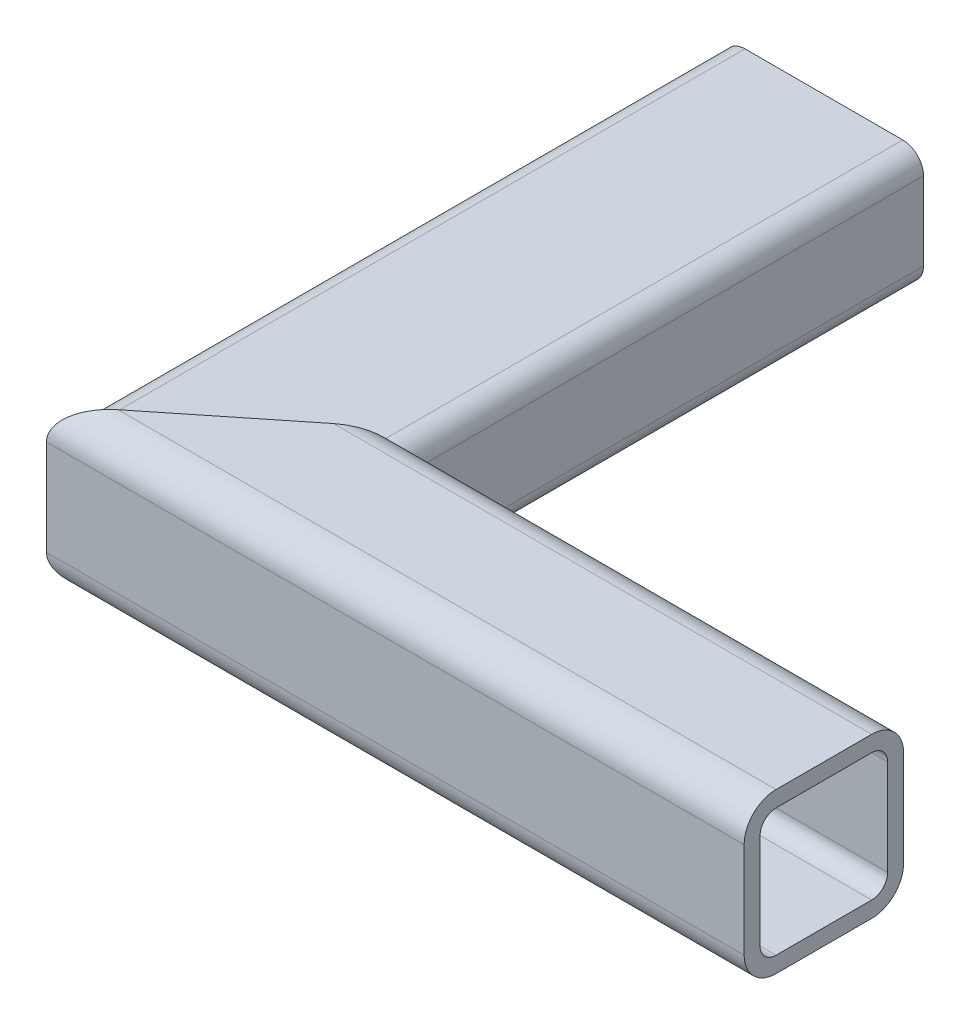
ISO-10303-21;
HEADER;
FILE_DESCRIPTION(('STEP AP214'),'2;1');
FILE_NAME('part.step','',(''),(''),'','','');
FILE_SCHEMA(('AUTOMOTIVE_DESIGN { 1 0 10303 214 1 1 1 1 }'));
ENDSEC;
DATA;
#1=APPLICATION_CONTEXT('core data for automotive mechanical design processes');
#2=APPLICATION_PROTOCOL_DEFINITION('international standard','automotive_design',2000,#1);
#3=PRODUCT_CONTEXT('',#1,'mechanical');
#4=PRODUCT('Part','Part','',(#3));
#5=PRODUCT_RELATED_PRODUCT_CATEGORY('part','',(#4));
#6=PRODUCT_DEFINITION_FORMATION('','',#4);
#7=PRODUCT_DEFINITION_CONTEXT('part definition',#1,'design');
#8=PRODUCT_DEFINITION('design','',#6,#7);
#9=PRODUCT_DEFINITION_SHAPE('','',#8);
#10=(LENGTH_UNIT() NAMED_UNIT(*) SI_UNIT(.MILLI.,.METRE.));
#11=(NAMED_UNIT(*) PLANE_ANGLE_UNIT() SI_UNIT($,.RADIAN.));
#12=(NAMED_UNIT(*) SI_UNIT($,.STERADIAN.) SOLID_ANGLE_UNIT());
#13=UNCERTAINTY_MEASURE_WITH_UNIT(LENGTH_MEASURE(1.E-05),#10,'distance_accuracy_value','');
#14=(GEOMETRIC_REPRESENTATION_CONTEXT(3) GLOBAL_UNCERTAINTY_ASSIGNED_CONTEXT((#13)) GLOBAL_UNIT_ASSIGNED_CONTEXT((#10,
#11,#12)) REPRESENTATION_CONTEXT('',''));
#15=CARTESIAN_POINT('',(0.,0.,0.));
#16=DIRECTION('',(0.,0.,1.));
#17=DIRECTION('',(1.,0.,0.));
#18=AXIS2_PLACEMENT_3D('',#15,#16,#17);
#19=CARTESIAN_POINT('',(19.8,-12.3999999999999,0.));
#20=DIRECTION('',(0.,1.,0.));
#21=DIRECTION('',(-1.,0.,0.));
#22=AXIS2_PLACEMENT_3D('',#19,#20,#21);
#23=PLANE('',#22);
#24=DIRECTION('',(-0.780868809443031,0.,0.624695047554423));
#25=VECTOR('',#24,1.);
#26=CARTESIAN_POINT('',(12.0731707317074,-12.4,-9.65853658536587));
#27=LINE('',#26,#25);
#28=CARTESIAN_POINT('',(19.8,-12.3999999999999,-15.84));
#29=VERTEX_POINT('',#28);
#30=CARTESIAN_POINT('',(-19.8,-12.4000000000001,15.8399999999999));
#31=VERTEX_POINT('',#30);
#32=EDGE_CURVE('E13',#29,#31,#27,.T.);
#33=ORIENTED_EDGE('',*,*,#32,.F.);
#34=DIRECTION('',(0.,0.,-1.));
#35=VECTOR('',#34,1.);
#36=CARTESIAN_POINT('',(19.8,-12.3999999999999,0.));
#37=LINE('',#36,#35);
#38=CARTESIAN_POINT('',(19.8,-12.3999999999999,-150.));
#39=VERTEX_POINT('',#38);
#40=EDGE_CURVE('E356',#29,#39,#37,.T.);
#41=ORIENTED_EDGE('',*,*,#40,.T.);
#42=DIRECTION('',(1.,0.,0.));
#43=VECTOR('',#42,1.);
#44=CARTESIAN_POINT('',(19.8,-12.3999999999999,-150.));
#45=LINE('',#44,#43);
#46=CARTESIAN_POINT('',(-19.8,-12.4000000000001,-150.));
#47=VERTEX_POINT('',#46);
#48=EDGE_CURVE('E314',#47,#39,#45,.T.);
#49=ORIENTED_EDGE('',*,*,#48,.F.);
#50=DIRECTION('',(0.,0.,-1.));
#51=VECTOR('',#50,1.);
#52=CARTESIAN_POINT('',(-19.8,-12.4000000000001,0.));
#53=LINE('',#52,#51);
#54=EDGE_CURVE('E289',#31,#47,#53,.T.);
#55=ORIENTED_EDGE('',*,*,#54,.F.);
#56=EDGE_LOOP('',(#33,#41,#49,#55));
#57=FACE_BOUND('',#56,.T.);
#58=ADVANCED_FACE('F153',(#57),#23,.T.);
#59=CARTESIAN_POINT('',(19.8,-9.79999999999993,0.));
#60=DIRECTION('',(0.,0.,-1.));
#61=DIRECTION('',(-1.,0.,0.));
#62=AXIS2_PLACEMENT_3D('',#59,#60,#61);
#63=CYLINDRICAL_SURFACE('',#62,2.6);
#64=CARTESIAN_POINT('',(19.8,-9.79999999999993,-15.84));
#65=DIRECTION('',(-0.624695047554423,0.,-0.780868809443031));
#66=DIRECTION('',(0.780868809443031,0.,-0.624695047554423));
#67=AXIS2_PLACEMENT_3D('',#64,#65,#66);
#68=ELLIPSE('',#67,3.32962460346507,2.6);
#69=CARTESIAN_POINT('',(22.4,-9.79999999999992,-17.92));
#70=VERTEX_POINT('',#69);
#71=EDGE_CURVE('E397',#70,#29,#68,.T.);
#72=ORIENTED_EDGE('',*,*,#71,.F.);
#73=DIRECTION('',(0.,0.,-1.));
#74=VECTOR('',#73,1.);
#75=CARTESIAN_POINT('',(22.4,-9.79999999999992,0.));
#76=LINE('',#75,#74);
#77=CARTESIAN_POINT('',(22.4,-9.79999999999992,-150.));
#78=VERTEX_POINT('',#77);
#79=EDGE_CURVE('E358',#70,#78,#76,.T.);
#80=ORIENTED_EDGE('',*,*,#79,.T.);
#81=CARTESIAN_POINT('',(19.8,-9.79999999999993,-150.));
#82=DIRECTION('',(0.,0.,1.));
#83=DIRECTION('',(1.,0.,0.));
#84=AXIS2_PLACEMENT_3D('',#81,#82,#83);
#85=CIRCLE('',#84,2.6);
#86=EDGE_CURVE('E311',#39,#78,#85,.T.);
#87=ORIENTED_EDGE('',*,*,#86,.F.);
#88=ORIENTED_EDGE('',*,*,#40,.F.);
#89=EDGE_LOOP('',(#72,#80,#87,#88));
#90=FACE_BOUND('',#89,.T.);
#91=ADVANCED_FACE('F414',(#90),#63,.F.);
#92=CARTESIAN_POINT('',(22.4,-9.79999999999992,0.));
#93=DIRECTION('',(-1.,0.,0.));
#94=DIRECTION('',(0.,-1.,0.));
#95=AXIS2_PLACEMENT_3D('',#92,#93,#94);
#96=PLANE('',#95);
#97=DIRECTION('',(0.,-1.,0.));
#98=VECTOR('',#97,1.);
#99=CARTESIAN_POINT('',(22.4,-9.79999999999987,-17.92));
#100=LINE('',#99,#98);
#101=CARTESIAN_POINT('',(22.4,9.80000000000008,-17.9199999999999));
#102=VERTEX_POINT('',#101);
#103=EDGE_CURVE('E201',#102,#70,#100,.T.);
#104=ORIENTED_EDGE('',*,*,#103,.F.);
#105=DIRECTION('',(0.,0.,-1.));
#106=VECTOR('',#105,1.);
#107=CARTESIAN_POINT('',(22.4,9.80000000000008,0.));
#108=LINE('',#107,#106);
#109=CARTESIAN_POINT('',(22.4,9.80000000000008,-150.));
#110=VERTEX_POINT('',#109);
#111=EDGE_CURVE('E360',#102,#110,#108,.T.);
#112=ORIENTED_EDGE('',*,*,#111,.T.);
#113=DIRECTION('',(0.,1.,0.));
#114=VECTOR('',#113,1.);
#115=CARTESIAN_POINT('',(22.4,-9.79999999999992,-150.));
#116=LINE('',#115,#114);
#117=EDGE_CURVE('E308',#78,#110,#116,.T.);
#118=ORIENTED_EDGE('',*,*,#117,.F.);
#119=ORIENTED_EDGE('',*,*,#79,.F.);
#120=EDGE_LOOP('',(#104,#112,#118,#119));
#121=FACE_BOUND('',#120,.T.);
#122=ADVANCED_FACE('F406',(#121),#96,.T.);
#123=CARTESIAN_POINT('',(19.8,9.80000000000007,0.));
#124=DIRECTION('',(0.,0.,-1.));
#125=DIRECTION('',(-1.,0.,0.));
#126=AXIS2_PLACEMENT_3D('',#123,#124,#125);
#127=CYLINDRICAL_SURFACE('',#126,2.6);
#128=CARTESIAN_POINT('',(19.8,9.80000000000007,-15.8399999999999));
#129=DIRECTION('',(-0.624695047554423,0.,-0.780868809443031));
#130=DIRECTION('',(0.780868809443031,0.,-0.624695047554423));
#131=AXIS2_PLACEMENT_3D('',#128,#129,#130);
#132=ELLIPSE('',#131,3.32962460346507,2.6);
#133=CARTESIAN_POINT('',(19.8,12.4000000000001,-15.8399999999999));
#134=VERTEX_POINT('',#133);
#135=EDGE_CURVE('E376',#134,#102,#132,.T.);
#136=ORIENTED_EDGE('',*,*,#135,.F.);
#137=DIRECTION('',(0.,0.,-1.));
#138=VECTOR('',#137,1.);
#139=CARTESIAN_POINT('',(19.8,12.4000000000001,0.));
#140=LINE('',#139,#138);
#141=CARTESIAN_POINT('',(19.8,12.4000000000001,-150.));
#142=VERTEX_POINT('',#141);
#143=EDGE_CURVE('E362',#134,#142,#140,.T.);
#144=ORIENTED_EDGE('',*,*,#143,.T.);
#145=CARTESIAN_POINT('',(19.8,9.80000000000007,-150.));
#146=DIRECTION('',(0.,0.,1.));
#147=DIRECTION('',(1.,0.,0.));
#148=AXIS2_PLACEMENT_3D('',#145,#146,#147);
#149=CIRCLE('',#148,2.6);
#150=EDGE_CURVE('E305',#110,#142,#149,.T.);
#151=ORIENTED_EDGE('',*,*,#150,.F.);
#152=ORIENTED_EDGE('',*,*,#111,.F.);
#153=EDGE_LOOP('',(#136,#144,#151,#152));
#154=FACE_BOUND('',#153,.T.);
#155=ADVANCED_FACE('F409',(#154),#127,.F.);
#156=CARTESIAN_POINT('',(-19.8,12.3999999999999,0.));
#157=DIRECTION('',(0.,-1.,0.));
#158=DIRECTION('',(1.,0.,0.));
#159=AXIS2_PLACEMENT_3D('',#156,#157,#158);
#160=PLANE('',#159);
#161=DIRECTION('',(0.780868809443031,0.,-0.624695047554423));
#162=VECTOR('',#161,1.);
#163=CARTESIAN_POINT('',(-12.0731707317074,12.4,9.65853658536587));
#164=LINE('',#163,#162);
#165=CARTESIAN_POINT('',(-19.8,12.3999999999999,15.84));
#166=VERTEX_POINT('',#165);
#167=EDGE_CURVE('E372',#166,#134,#164,.T.);
#168=ORIENTED_EDGE('',*,*,#167,.F.);
#169=DIRECTION('',(0.,0.,-1.));
#170=VECTOR('',#169,1.);
#171=CARTESIAN_POINT('',(-19.8,12.3999999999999,0.));
#172=LINE('',#171,#170);
#173=CARTESIAN_POINT('',(-19.8,12.3999999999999,-150.));
#174=VERTEX_POINT('',#173);
#175=EDGE_CURVE('E364',#166,#174,#172,.T.);
#176=ORIENTED_EDGE('',*,*,#175,.T.);
#177=DIRECTION('',(-1.,0.,0.));
#178=VECTOR('',#177,1.);
#179=CARTESIAN_POINT('',(-19.8,12.3999999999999,-150.));
#180=LINE('',#179,#178);
#181=EDGE_CURVE('E300',#142,#174,#180,.T.);
#182=ORIENTED_EDGE('',*,*,#181,.F.);
#183=ORIENTED_EDGE('',*,*,#143,.F.);
#184=EDGE_LOOP('',(#168,#176,#182,#183));
#185=FACE_BOUND('',#184,.T.);
#186=ADVANCED_FACE('F431',(#185),#160,.T.);
#187=CARTESIAN_POINT('',(-19.8,9.79999999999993,0.));
#188=DIRECTION('',(0.,0.,-1.));
#189=DIRECTION('',(-1.,0.,0.));
#190=AXIS2_PLACEMENT_3D('',#187,#188,#189);
#191=CYLINDRICAL_SURFACE('',#190,2.6);
#192=CARTESIAN_POINT('',(-19.8,9.79999999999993,15.84));
#193=DIRECTION('',(-0.624695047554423,0.,-0.780868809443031));
#194=DIRECTION('',(0.780868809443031,0.,-0.624695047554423));
#195=AXIS2_PLACEMENT_3D('',#192,#193,#194);
#196=ELLIPSE('',#195,3.32962460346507,2.6);
#197=CARTESIAN_POINT('',(-22.4,9.79999999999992,17.92));
#198=VERTEX_POINT('',#197);
#199=EDGE_CURVE('E370',#198,#166,#196,.T.);
#200=ORIENTED_EDGE('',*,*,#199,.F.);
#201=DIRECTION('',(0.,0.,-1.));
#202=VECTOR('',#201,1.);
#203=CARTESIAN_POINT('',(-22.4,9.79999999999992,0.));
#204=LINE('',#203,#202);
#205=CARTESIAN_POINT('',(-22.4,9.79999999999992,-150.));
#206=VERTEX_POINT('',#205);
#207=EDGE_CURVE('E285',#198,#206,#204,.T.);
#208=ORIENTED_EDGE('',*,*,#207,.T.);
#209=CARTESIAN_POINT('',(-19.8,9.79999999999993,-150.));
#210=DIRECTION('',(0.,0.,1.));
#211=DIRECTION('',(1.,0.,0.));
#212=AXIS2_PLACEMENT_3D('',#209,#210,#211);
#213=CIRCLE('',#212,2.6);
#214=EDGE_CURVE('E298',#174,#206,#213,.T.);
#215=ORIENTED_EDGE('',*,*,#214,.F.);
#216=ORIENTED_EDGE('',*,*,#175,.F.);
#217=EDGE_LOOP('',(#200,#208,#215,#216));
#218=FACE_BOUND('',#217,.T.);
#219=ADVANCED_FACE('F368',(#218),#191,.F.);
#220=CARTESIAN_POINT('',(-22.4,9.79999999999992,0.));
#221=DIRECTION('',(1.,0.,0.));
#222=DIRECTION('',(0.,1.,0.));
#223=AXIS2_PLACEMENT_3D('',#220,#221,#222);
#224=PLANE('',#223);
#225=DIRECTION('',(0.,1.,0.));
#226=VECTOR('',#225,1.);
#227=CARTESIAN_POINT('',(-22.4,9.79999999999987,17.92));
#228=LINE('',#227,#226);
#229=CARTESIAN_POINT('',(-22.4,-9.80000000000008,17.9199999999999));
#230=VERTEX_POINT('',#229);
#231=EDGE_CURVE('E281',#230,#198,#228,.T.);
#232=ORIENTED_EDGE('',*,*,#231,.F.);
#233=DIRECTION('',(0.,0.,-1.));
#234=VECTOR('',#233,1.);
#235=CARTESIAN_POINT('',(-22.4,-9.80000000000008,0.));
#236=LINE('',#235,#234);
#237=CARTESIAN_POINT('',(-22.4,-9.80000000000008,-150.));
#238=VERTEX_POINT('',#237);
#239=EDGE_CURVE('E274',#230,#238,#236,.T.);
#240=ORIENTED_EDGE('',*,*,#239,.T.);
#241=DIRECTION('',(0.,-1.,0.));
#242=VECTOR('',#241,1.);
#243=CARTESIAN_POINT('',(-22.4,9.79999999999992,-150.));
#244=LINE('',#243,#242);
#245=EDGE_CURVE('E279',#206,#238,#244,.T.);
#246=ORIENTED_EDGE('',*,*,#245,.F.);
#247=ORIENTED_EDGE('',*,*,#207,.F.);
#248=EDGE_LOOP('',(#232,#240,#246,#247));
#249=FACE_BOUND('',#248,.T.);
#250=ADVANCED_FACE('F276',(#249),#224,.T.);
#251=CARTESIAN_POINT('',(-19.8,-9.80000000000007,0.));
#252=DIRECTION('',(0.,0.,-1.));
#253=DIRECTION('',(-1.,0.,0.));
#254=AXIS2_PLACEMENT_3D('',#251,#252,#253);
#255=CYLINDRICAL_SURFACE('',#254,2.6);
#256=CARTESIAN_POINT('',(-19.8,-9.80000000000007,15.8399999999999));
#257=DIRECTION('',(-0.624695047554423,0.,-0.780868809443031));
#258=DIRECTION('',(0.780868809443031,0.,-0.624695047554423));
#259=AXIS2_PLACEMENT_3D('',#256,#257,#258);
#260=ELLIPSE('',#259,3.32962460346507,2.6);
#261=EDGE_CURVE('E374',#31,#230,#260,.T.);
#262=ORIENTED_EDGE('',*,*,#261,.F.);
#263=ORIENTED_EDGE('',*,*,#54,.T.);
#264=CARTESIAN_POINT('',(-19.8,-9.80000000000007,-150.));
#265=DIRECTION('',(0.,0.,1.));
#266=DIRECTION('',(1.,0.,0.));
#267=AXIS2_PLACEMENT_3D('',#264,#265,#266);
#268=CIRCLE('',#267,2.6);
#269=EDGE_CURVE('E287',#238,#47,#268,.T.);
#270=ORIENTED_EDGE('',*,*,#269,.F.);
#271=ORIENTED_EDGE('',*,*,#239,.F.);
#272=EDGE_LOOP('',(#262,#263,#270,#271));
#273=FACE_BOUND('',#272,.T.);
#274=ADVANCED_FACE('F155',(#273),#255,.F.);
#275=CARTESIAN_POINT('',(-19.8,9.79999999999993,-150.));
#276=DIRECTION('',(0.,0.,1.));
#277=DIRECTION('',(1.,0.,0.));
#278=AXIS2_PLACEMENT_3D('',#275,#276,#277);
#279=PLANE('',#278);
#280=ORIENTED_EDGE('',*,*,#269,.T.);
#281=ORIENTED_EDGE('',*,*,#48,.T.);
#282=ORIENTED_EDGE('',*,*,#86,.T.);
#283=ORIENTED_EDGE('',*,*,#117,.T.);
#284=ORIENTED_EDGE('',*,*,#150,.T.);
#285=ORIENTED_EDGE('',*,*,#181,.T.);
#286=ORIENTED_EDGE('',*,*,#214,.T.);
#287=ORIENTED_EDGE('',*,*,#245,.T.);
#288=EDGE_LOOP('',(#280,#281,#282,#283,#284,#285,#286,#287));
#289=FACE_BOUND('',#288,.T.);
#290=CARTESIAN_POINT('',(-19.8,9.79999999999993,-150.));
#291=DIRECTION('',(0.,0.,1.));
#292=DIRECTION('',(1.,0.,0.));
#293=AXIS2_PLACEMENT_3D('',#290,#291,#292);
#294=CIRCLE('',#293,5.2);
#295=CARTESIAN_POINT('',(-19.8000000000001,14.9999999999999,-150.));
#296=VERTEX_POINT('',#295);
#297=CARTESIAN_POINT('',(-25.,9.79999999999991,-150.));
#298=VERTEX_POINT('',#297);
#299=EDGE_CURVE('E316',#296,#298,#294,.T.);
#300=ORIENTED_EDGE('',*,*,#299,.F.);
#301=DIRECTION('',(-1.,0.,0.));
#302=VECTOR('',#301,1.);
#303=CARTESIAN_POINT('',(-19.8000000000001,14.9999999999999,-150.));
#304=LINE('',#303,#302);
#305=CARTESIAN_POINT('',(19.7999999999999,15.0000000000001,-150.));
#306=VERTEX_POINT('',#305);
#307=EDGE_CURVE('E337',#306,#296,#304,.T.);
#308=ORIENTED_EDGE('',*,*,#307,.F.);
#309=CARTESIAN_POINT('',(19.8,9.80000000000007,-150.));
#310=DIRECTION('',(0.,0.,1.));
#311=DIRECTION('',(1.,0.,0.));
#312=AXIS2_PLACEMENT_3D('',#309,#310,#311);
#313=CIRCLE('',#312,5.2);
#314=CARTESIAN_POINT('',(25.,9.80000000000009,-150.));
#315=VERTEX_POINT('',#314);
#316=EDGE_CURVE('E334',#315,#306,#313,.T.);
#317=ORIENTED_EDGE('',*,*,#316,.F.);
#318=DIRECTION('',(0.,1.,0.));
#319=VECTOR('',#318,1.);
#320=CARTESIAN_POINT('',(25.,-9.79999999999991,-150.));
#321=LINE('',#320,#319);
#322=CARTESIAN_POINT('',(25.,-9.79999999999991,-150.));
#323=VERTEX_POINT('',#322);
#324=EDGE_CURVE('E331',#323,#315,#321,.T.);
#325=ORIENTED_EDGE('',*,*,#324,.F.);
#326=CARTESIAN_POINT('',(19.8,-9.79999999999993,-150.));
#327=DIRECTION('',(0.,0.,1.));
#328=DIRECTION('',(1.,0.,0.));
#329=AXIS2_PLACEMENT_3D('',#326,#327,#328);
#330=CIRCLE('',#329,5.2);
#331=CARTESIAN_POINT('',(19.8,-14.9999999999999,-150.));
#332=VERTEX_POINT('',#331);
#333=EDGE_CURVE('E328',#332,#323,#330,.T.);
#334=ORIENTED_EDGE('',*,*,#333,.F.);
#335=DIRECTION('',(1.,0.,0.));
#336=VECTOR('',#335,1.);
#337=CARTESIAN_POINT('',(19.8000000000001,-14.9999999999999,-150.));
#338=LINE('',#337,#336);
#339=CARTESIAN_POINT('',(-19.8,-15.0000000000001,-150.));
#340=VERTEX_POINT('',#339);
#341=EDGE_CURVE('E325',#340,#332,#338,.T.);
#342=ORIENTED_EDGE('',*,*,#341,.F.);
#343=CARTESIAN_POINT('',(-19.8,-9.80000000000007,-150.));
#344=DIRECTION('',(0.,0.,1.));
#345=DIRECTION('',(1.,0.,0.));
#346=AXIS2_PLACEMENT_3D('',#343,#344,#345);
#347=CIRCLE('',#346,5.2);
#348=CARTESIAN_POINT('',(-25.,-9.80000000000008,-150.));
#349=VERTEX_POINT('',#348);
#350=EDGE_CURVE('E322',#349,#340,#347,.T.);
#351=ORIENTED_EDGE('',*,*,#350,.F.);
#352=DIRECTION('',(0.,-1.,0.));
#353=VECTOR('',#352,1.);
#354=CARTESIAN_POINT('',(-25.,9.79999999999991,-150.));
#355=LINE('',#354,#353);
#356=EDGE_CURVE('E319',#298,#349,#355,.T.);
#357=ORIENTED_EDGE('',*,*,#356,.F.);
#358=EDGE_LOOP('',(#300,#308,#317,#325,#334,#342,#351,#357));
#359=FACE_BOUND('',#358,.T.);
#360=ADVANCED_FACE('F294',(#289,#359),#279,.F.);
#361=CARTESIAN_POINT('',(-19.8000000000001,14.9999999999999,0.));
#362=DIRECTION('',(0.,-1.,0.));
#363=DIRECTION('',(1.,0.,0.));
#364=AXIS2_PLACEMENT_3D('',#361,#362,#363);
#365=PLANE('',#364);
#366=DIRECTION('',(0.,0.,-1.));
#367=VECTOR('',#366,1.);
#368=CARTESIAN_POINT('',(-19.8000000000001,14.9999999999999,0.));
#369=LINE('',#368,#367);
#370=CARTESIAN_POINT('',(-19.8000000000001,14.9999999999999,15.84));
#371=VERTEX_POINT('',#370);
#372=EDGE_CURVE('E284',#371,#296,#369,.T.);
#373=ORIENTED_EDGE('',*,*,#372,.F.);
#374=DIRECTION('',(0.780868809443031,0.,-0.624695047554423));
#375=VECTOR('',#374,1.);
#376=CARTESIAN_POINT('',(-12.0731707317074,15.,9.65853658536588));
#377=LINE('',#376,#375);
#378=CARTESIAN_POINT('',(19.8,15.0000000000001,-15.8399999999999));
#379=VERTEX_POINT('',#378);
#380=EDGE_CURVE('E157',#371,#379,#377,.T.);
#381=ORIENTED_EDGE('',*,*,#380,.T.);
#382=DIRECTION('',(0.,0.,-1.));
#383=VECTOR('',#382,1.);
#384=CARTESIAN_POINT('',(19.8,15.0000000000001,0.));
#385=LINE('',#384,#383);
#386=EDGE_CURVE('E341',#379,#306,#385,.T.);
#387=ORIENTED_EDGE('',*,*,#386,.T.);
#388=ORIENTED_EDGE('',*,*,#307,.T.);
#389=EDGE_LOOP('',(#373,#381,#387,#388));
#390=FACE_BOUND('',#389,.T.);
#391=ADVANCED_FACE('F443',(#390),#365,.F.);
#392=CARTESIAN_POINT('',(19.8,9.80000000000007,0.));
#393=DIRECTION('',(0.,0.,-1.));
#394=DIRECTION('',(-1.,0.,0.));
#395=AXIS2_PLACEMENT_3D('',#392,#393,#394);
#396=CYLINDRICAL_SURFACE('',#395,5.2);
#397=ORIENTED_EDGE('',*,*,#386,.F.);
#398=CARTESIAN_POINT('',(19.8,9.80000000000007,-15.8399999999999));
#399=DIRECTION('',(-0.624695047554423,0.,-0.780868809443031));
#400=DIRECTION('',(0.780868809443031,0.,-0.624695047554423));
#401=AXIS2_PLACEMENT_3D('',#398,#399,#400);
#402=ELLIPSE('',#401,6.65924920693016,5.2);
#403=CARTESIAN_POINT('',(25.,9.80000000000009,-19.9999999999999));
#404=VERTEX_POINT('',#403);
#405=EDGE_CURVE('E379',#379,#404,#402,.T.);
#406=ORIENTED_EDGE('',*,*,#405,.T.);
#407=DIRECTION('',(0.,0.,-1.));
#408=VECTOR('',#407,1.);
#409=CARTESIAN_POINT('',(25.,9.80000000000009,0.));
#410=LINE('',#409,#408);
#411=EDGE_CURVE('E343',#404,#315,#410,.T.);
#412=ORIENTED_EDGE('',*,*,#411,.T.);
#413=ORIENTED_EDGE('',*,*,#316,.T.);
#414=EDGE_LOOP('',(#397,#406,#412,#413));
#415=FACE_BOUND('',#414,.T.);
#416=ADVANCED_FACE('F448',(#415),#396,.T.);
#417=CARTESIAN_POINT('',(25.,-9.79999999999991,0.));
#418=DIRECTION('',(-1.,0.,0.));
#419=DIRECTION('',(0.,-1.,0.));
#420=AXIS2_PLACEMENT_3D('',#417,#418,#419);
#421=PLANE('',#420);
#422=ORIENTED_EDGE('',*,*,#411,.F.);
#423=DIRECTION('',(0.,-1.,0.));
#424=VECTOR('',#423,1.);
#425=CARTESIAN_POINT('',(25.,-9.79999999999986,-20.));
#426=LINE('',#425,#424);
#427=CARTESIAN_POINT('',(25.,-9.79999999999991,-20.));
#428=VERTEX_POINT('',#427);
#429=EDGE_CURVE('E188',#404,#428,#426,.T.);
#430=ORIENTED_EDGE('',*,*,#429,.T.);
#431=DIRECTION('',(0.,0.,-1.));
#432=VECTOR('',#431,1.);
#433=CARTESIAN_POINT('',(25.,-9.79999999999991,0.));
#434=LINE('',#433,#432);
#435=EDGE_CURVE('E345',#428,#323,#434,.T.);
#436=ORIENTED_EDGE('',*,*,#435,.T.);
#437=ORIENTED_EDGE('',*,*,#324,.T.);
#438=EDGE_LOOP('',(#422,#430,#436,#437));
#439=FACE_BOUND('',#438,.T.);
#440=ADVANCED_FACE('F455',(#439),#421,.F.);
#441=CARTESIAN_POINT('',(19.8,-9.79999999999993,0.));
#442=DIRECTION('',(0.,0.,-1.));
#443=DIRECTION('',(-1.,0.,0.));
#444=AXIS2_PLACEMENT_3D('',#441,#442,#443);
#445=CYLINDRICAL_SURFACE('',#444,5.2);
#446=ORIENTED_EDGE('',*,*,#435,.F.);
#447=CARTESIAN_POINT('',(19.8,-9.79999999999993,-15.84));
#448=DIRECTION('',(-0.624695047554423,0.,-0.780868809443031));
#449=DIRECTION('',(0.780868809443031,0.,-0.624695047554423));
#450=AXIS2_PLACEMENT_3D('',#447,#448,#449);
#451=ELLIPSE('',#450,6.65924920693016,5.2);
#452=CARTESIAN_POINT('',(19.8000000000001,-14.9999999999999,-15.84));
#453=VERTEX_POINT('',#452);
#454=EDGE_CURVE('E384',#428,#453,#451,.T.);
#455=ORIENTED_EDGE('',*,*,#454,.T.);
#456=DIRECTION('',(0.,0.,-1.));
#457=VECTOR('',#456,1.);
#458=CARTESIAN_POINT('',(19.8000000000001,-14.9999999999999,0.));
#459=LINE('',#458,#457);
#460=EDGE_CURVE('E347',#453,#332,#459,.T.);
#461=ORIENTED_EDGE('',*,*,#460,.T.);
#462=ORIENTED_EDGE('',*,*,#333,.T.);
#463=EDGE_LOOP('',(#446,#455,#461,#462));
#464=FACE_BOUND('',#463,.T.);
#465=ADVANCED_FACE('F458',(#464),#445,.T.);
#466=CARTESIAN_POINT('',(19.8000000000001,-14.9999999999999,0.));
#467=DIRECTION('',(0.,1.,0.));
#468=DIRECTION('',(-1.,0.,0.));
#469=AXIS2_PLACEMENT_3D('',#466,#467,#468);
#470=PLANE('',#469);
#471=ORIENTED_EDGE('',*,*,#460,.F.);
#472=DIRECTION('',(-0.780868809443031,0.,0.624695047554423));
#473=VECTOR('',#472,1.);
#474=CARTESIAN_POINT('',(12.0731707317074,-15.,-9.65853658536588));
#475=LINE('',#474,#473);
#476=CARTESIAN_POINT('',(-19.8,-15.0000000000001,15.8399999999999));
#477=VERTEX_POINT('',#476);
#478=EDGE_CURVE('E389',#453,#477,#475,.T.);
#479=ORIENTED_EDGE('',*,*,#478,.T.);
#480=DIRECTION('',(0.,0.,-1.));
#481=VECTOR('',#480,1.);
#482=CARTESIAN_POINT('',(-19.8,-15.0000000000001,0.));
#483=LINE('',#482,#481);
#484=EDGE_CURVE('E349',#477,#340,#483,.T.);
#485=ORIENTED_EDGE('',*,*,#484,.T.);
#486=ORIENTED_EDGE('',*,*,#341,.T.);
#487=EDGE_LOOP('',(#471,#479,#485,#486));
#488=FACE_BOUND('',#487,.T.);
#489=ADVANCED_FACE('F462',(#488),#470,.F.);
#490=CARTESIAN_POINT('',(-19.8,-9.80000000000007,0.));
#491=DIRECTION('',(0.,0.,-1.));
#492=DIRECTION('',(-1.,0.,0.));
#493=AXIS2_PLACEMENT_3D('',#490,#491,#492);
#494=CYLINDRICAL_SURFACE('',#493,5.2);
#495=ORIENTED_EDGE('',*,*,#484,.F.);
#496=CARTESIAN_POINT('',(-19.8,-9.80000000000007,15.8399999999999));
#497=DIRECTION('',(-0.624695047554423,0.,-0.780868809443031));
#498=DIRECTION('',(0.780868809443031,0.,-0.624695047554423));
#499=AXIS2_PLACEMENT_3D('',#496,#497,#498);
#500=ELLIPSE('',#499,6.65924920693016,5.2);
#501=CARTESIAN_POINT('',(-25.,-9.80000000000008,19.9999999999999));
#502=VERTEX_POINT('',#501);
#503=EDGE_CURVE('E392',#477,#502,#500,.T.);
#504=ORIENTED_EDGE('',*,*,#503,.T.);
#505=DIRECTION('',(0.,0.,-1.));
#506=VECTOR('',#505,1.);
#507=CARTESIAN_POINT('',(-25.,-9.80000000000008,0.));
#508=LINE('',#507,#506);
#509=EDGE_CURVE('E351',#502,#349,#508,.T.);
#510=ORIENTED_EDGE('',*,*,#509,.T.);
#511=ORIENTED_EDGE('',*,*,#350,.T.);
#512=EDGE_LOOP('',(#495,#504,#510,#511));
#513=FACE_BOUND('',#512,.T.);
#514=ADVANCED_FACE('F466',(#513),#494,.T.);
#515=CARTESIAN_POINT('',(-25.,9.79999999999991,0.));
#516=DIRECTION('',(1.,0.,0.));
#517=DIRECTION('',(0.,1.,0.));
#518=AXIS2_PLACEMENT_3D('',#515,#516,#517);
#519=PLANE('',#518);
#520=ORIENTED_EDGE('',*,*,#509,.F.);
#521=DIRECTION('',(0.,1.,0.));
#522=VECTOR('',#521,1.);
#523=CARTESIAN_POINT('',(-25.,9.79999999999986,20.));
#524=LINE('',#523,#522);
#525=CARTESIAN_POINT('',(-25.,9.79999999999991,20.));
#526=VERTEX_POINT('',#525);
#527=EDGE_CURVE('E172',#502,#526,#524,.T.);
#528=ORIENTED_EDGE('',*,*,#527,.T.);
#529=DIRECTION('',(0.,0.,-1.));
#530=VECTOR('',#529,1.);
#531=CARTESIAN_POINT('',(-25.,9.79999999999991,0.));
#532=LINE('',#531,#530);
#533=EDGE_CURVE('E353',#526,#298,#532,.T.);
#534=ORIENTED_EDGE('',*,*,#533,.T.);
#535=ORIENTED_EDGE('',*,*,#356,.T.);
#536=EDGE_LOOP('',(#520,#528,#534,#535));
#537=FACE_BOUND('',#536,.T.);
#538=ADVANCED_FACE('F469',(#537),#519,.F.);
#539=CARTESIAN_POINT('',(-19.8,9.79999999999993,0.));
#540=DIRECTION('',(0.,0.,-1.));
#541=DIRECTION('',(-1.,0.,0.));
#542=AXIS2_PLACEMENT_3D('',#539,#540,#541);
#543=CYLINDRICAL_SURFACE('',#542,5.2);
#544=ORIENTED_EDGE('',*,*,#533,.F.);
#545=CARTESIAN_POINT('',(-19.8,9.79999999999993,15.84));
#546=DIRECTION('',(-0.624695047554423,0.,-0.780868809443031));
#547=DIRECTION('',(0.780868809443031,0.,-0.624695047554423));
#548=AXIS2_PLACEMENT_3D('',#545,#546,#547);
#549=ELLIPSE('',#548,6.65924920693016,5.2);
#550=EDGE_CURVE('E163',#526,#371,#549,.T.);
#551=ORIENTED_EDGE('',*,*,#550,.T.);
#552=ORIENTED_EDGE('',*,*,#372,.T.);
#553=ORIENTED_EDGE('',*,*,#299,.T.);
#554=EDGE_LOOP('',(#544,#551,#552,#553));
#555=FACE_BOUND('',#554,.T.);
#556=ADVANCED_FACE('F424',(#555),#543,.T.);
#557=CARTESIAN_POINT('',(0.,0.,0.));
#558=DIRECTION('',(-0.624695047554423,0.,-0.780868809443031));
#559=DIRECTION('',(-0.780868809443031,0.,0.624695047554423));
#560=AXIS2_PLACEMENT_3D('',#557,#558,#559);
#561=PLANE('',#560);
#562=ORIENTED_EDGE('',*,*,#261,.T.);
#563=ORIENTED_EDGE('',*,*,#231,.T.);
#564=ORIENTED_EDGE('',*,*,#199,.T.);
#565=ORIENTED_EDGE('',*,*,#167,.T.);
#566=ORIENTED_EDGE('',*,*,#135,.T.);
#567=ORIENTED_EDGE('',*,*,#103,.T.);
#568=ORIENTED_EDGE('',*,*,#71,.T.);
#569=ORIENTED_EDGE('',*,*,#32,.T.);
#570=EDGE_LOOP('',(#562,#563,#564,#565,#566,#567,#568,#569));
#571=FACE_BOUND('',#570,.T.);
#572=ORIENTED_EDGE('',*,*,#527,.F.);
#573=ORIENTED_EDGE('',*,*,#503,.F.);
#574=ORIENTED_EDGE('',*,*,#478,.F.);
#575=ORIENTED_EDGE('',*,*,#454,.F.);
#576=ORIENTED_EDGE('',*,*,#429,.F.);
#577=ORIENTED_EDGE('',*,*,#405,.F.);
#578=ORIENTED_EDGE('',*,*,#380,.F.);
#579=ORIENTED_EDGE('',*,*,#550,.F.);
#580=EDGE_LOOP('',(#572,#573,#574,#575,#576,#577,#578,#579));
#581=FACE_BOUND('',#580,.T.);
#582=ADVANCED_FACE('F400',(#571,#581),#561,.F.);
#583=CLOSED_SHELL('',(#58,#91,#122,#155,#186,#219,#250,#274,#360,#391,#416,#440,#465,#489,#514,
#538,#556,#582));
#584=MANIFOLD_SOLID_BREP('B2',#583);
#585=CARTESIAN_POINT('',(150.,12.,-12.));
#586=DIRECTION('',(-1.,0.,0.));
#587=DIRECTION('',(0.,0.,1.));
#588=AXIS2_PLACEMENT_3D('',#585,#586,#587);
#589=CYLINDRICAL_SURFACE('',#588,8.);
#590=CARTESIAN_POINT('',(15.,12.,-12.));
#591=DIRECTION('',(-0.624695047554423,0.,-0.780868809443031));
#592=DIRECTION('',(-0.780868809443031,0.,0.624695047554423));
#593=AXIS2_PLACEMENT_3D('',#590,#591,#592);
#594=ELLIPSE('',#593,12.8062484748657,8.);
#595=CARTESIAN_POINT('',(15.,20.,-12.));
#596=VERTEX_POINT('',#595);
#597=CARTESIAN_POINT('',(25.0000000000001,12.,-20.));
#598=VERTEX_POINT('',#597);
#599=EDGE_CURVE('E834',#596,#598,#594,.T.);
#600=ORIENTED_EDGE('',*,*,#599,.F.);
#601=DIRECTION('',(-1.,0.,0.));
#602=VECTOR('',#601,1.);
#603=CARTESIAN_POINT('',(150.,20.,-12.));
#604=LINE('',#603,#602);
#605=CARTESIAN_POINT('',(150.,20.,-12.));
#606=VERTEX_POINT('',#605);
#607=EDGE_CURVE('E890',#606,#596,#604,.T.);
#608=ORIENTED_EDGE('',*,*,#607,.F.);
#609=CARTESIAN_POINT('',(150.,12.,-12.));
#610=DIRECTION('',(1.,0.,0.));
#611=DIRECTION('',(0.,0.,-1.));
#612=AXIS2_PLACEMENT_3D('',#609,#610,#611);
#613=CIRCLE('',#612,8.);
#614=CARTESIAN_POINT('',(150.,12.,-20.));
#615=VERTEX_POINT('',#614);
#616=EDGE_CURVE('E919',#615,#606,#613,.T.);
#617=ORIENTED_EDGE('',*,*,#616,.F.);
#618=DIRECTION('',(-1.,0.,0.));
#619=VECTOR('',#618,1.);
#620=CARTESIAN_POINT('',(150.,12.,-20.));
#621=LINE('',#620,#619);
#622=EDGE_CURVE('E895',#615,#598,#621,.T.);
#623=ORIENTED_EDGE('',*,*,#622,.T.);
#624=EDGE_LOOP('',(#600,#608,#617,#623));
#625=FACE_BOUND('',#624,.T.);
#626=ADVANCED_FACE('F680',(#625),#589,.T.);
#627=CARTESIAN_POINT('',(150.,20.,-12.));
#628=DIRECTION('',(0.,-1.,0.));
#629=DIRECTION('',(0.,0.,-1.));
#630=AXIS2_PLACEMENT_3D('',#627,#628,#629);
#631=PLANE('',#630);
#632=DIRECTION('',(0.780868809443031,0.,-0.624695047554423));
#633=VECTOR('',#632,1.);
#634=CARTESIAN_POINT('',(97.3170731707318,20.,-77.8536585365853));
#635=LINE('',#634,#633);
#636=CARTESIAN_POINT('',(-15.,20.,12.));
#637=VERTEX_POINT('',#636);
#638=EDGE_CURVE('E839',#637,#596,#635,.T.);
#639=ORIENTED_EDGE('',*,*,#638,.F.);
#640=DIRECTION('',(-1.,0.,0.));
#641=VECTOR('',#640,1.);
#642=CARTESIAN_POINT('',(150.,20.,12.));
#643=LINE('',#642,#641);
#644=CARTESIAN_POINT('',(150.,20.,12.));
#645=VERTEX_POINT('',#644);
#646=EDGE_CURVE('E894',#645,#637,#643,.T.);
#647=ORIENTED_EDGE('',*,*,#646,.F.);
#648=DIRECTION('',(0.,0.,1.));
#649=VECTOR('',#648,1.);
#650=CARTESIAN_POINT('',(150.,20.,-12.));
#651=LINE('',#650,#649);
#652=EDGE_CURVE('E964',#606,#645,#651,.T.);
#653=ORIENTED_EDGE('',*,*,#652,.F.);
#654=ORIENTED_EDGE('',*,*,#607,.T.);
#655=EDGE_LOOP('',(#639,#647,#653,#654));
#656=FACE_BOUND('',#655,.T.);
#657=ADVANCED_FACE('F994',(#656),#631,.F.);
#658=CARTESIAN_POINT('',(150.,12.,12.));
#659=DIRECTION('',(-1.,0.,0.));
#660=DIRECTION('',(0.,0.,1.));
#661=AXIS2_PLACEMENT_3D('',#658,#659,#660);
#662=CYLINDRICAL_SURFACE('',#661,8.);
#663=CARTESIAN_POINT('',(-15.,12.,12.));
#664=DIRECTION('',(-0.624695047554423,0.,-0.780868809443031));
#665=DIRECTION('',(-0.780868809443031,0.,0.624695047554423));
#666=AXIS2_PLACEMENT_3D('',#663,#664,#665);
#667=ELLIPSE('',#666,12.8062484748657,8.);
#668=CARTESIAN_POINT('',(-25.,12.,20.));
#669=VERTEX_POINT('',#668);
#670=EDGE_CURVE('E151',#669,#637,#667,.T.);
#671=ORIENTED_EDGE('',*,*,#670,.F.);
#672=DIRECTION('',(-1.,0.,0.));
#673=VECTOR('',#672,1.);
#674=CARTESIAN_POINT('',(150.,12.,20.));
#675=LINE('',#674,#673);
#676=CARTESIAN_POINT('',(150.,12.,20.));
#677=VERTEX_POINT('',#676);
#678=EDGE_CURVE('E899',#677,#669,#675,.T.);
#679=ORIENTED_EDGE('',*,*,#678,.F.);
#680=CARTESIAN_POINT('',(150.,12.,12.));
#681=DIRECTION('',(1.,0.,0.));
#682=DIRECTION('',(0.,0.,-1.));
#683=AXIS2_PLACEMENT_3D('',#680,#681,#682);
#684=CIRCLE('',#683,8.);
#685=EDGE_CURVE('E966',#645,#677,#684,.T.);
#686=ORIENTED_EDGE('',*,*,#685,.F.);
#687=ORIENTED_EDGE('',*,*,#646,.T.);
#688=EDGE_LOOP('',(#671,#679,#686,#687));
#689=FACE_BOUND('',#688,.T.);
#690=ADVANCED_FACE('F999',(#689),#662,.T.);
#691=CARTESIAN_POINT('',(150.,-12.,20.));
#692=DIRECTION('',(0.,0.,-1.));
#693=DIRECTION('',(-1.,0.,0.));
#694=AXIS2_PLACEMENT_3D('',#691,#692,#693);
#695=PLANE('',#694);
#696=DIRECTION('',(0.,1.,0.));
#697=VECTOR('',#696,1.);
#698=CARTESIAN_POINT('',(-25.,-12.,20.));
#699=LINE('',#698,#697);
#700=CARTESIAN_POINT('',(-25.,-12.,20.));
#701=VERTEX_POINT('',#700);
#702=EDGE_CURVE('E691',#701,#669,#699,.T.);
#703=ORIENTED_EDGE('',*,*,#702,.F.);
#704=DIRECTION('',(-1.,0.,0.));
#705=VECTOR('',#704,1.);
#706=CARTESIAN_POINT('',(150.,-12.,20.));
#707=LINE('',#706,#705);
#708=CARTESIAN_POINT('',(150.,-12.,20.));
#709=VERTEX_POINT('',#708);
#710=EDGE_CURVE('E903',#709,#701,#707,.T.);
#711=ORIENTED_EDGE('',*,*,#710,.F.);
#712=DIRECTION('',(0.,-1.,0.));
#713=VECTOR('',#712,1.);
#714=CARTESIAN_POINT('',(150.,-12.,20.));
#715=LINE('',#714,#713);
#716=EDGE_CURVE('E969',#677,#709,#715,.T.);
#717=ORIENTED_EDGE('',*,*,#716,.F.);
#718=ORIENTED_EDGE('',*,*,#678,.T.);
#719=EDGE_LOOP('',(#703,#711,#717,#718));
#720=FACE_BOUND('',#719,.T.);
#721=ADVANCED_FACE('F1003',(#720),#695,.F.);
#722=CARTESIAN_POINT('',(150.,-12.,12.));
#723=DIRECTION('',(-1.,0.,0.));
#724=DIRECTION('',(0.,0.,1.));
#725=AXIS2_PLACEMENT_3D('',#722,#723,#724);
#726=CYLINDRICAL_SURFACE('',#725,8.);
#727=CARTESIAN_POINT('',(-15.,-12.,12.));
#728=DIRECTION('',(-0.624695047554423,0.,-0.780868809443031));
#729=DIRECTION('',(-0.780868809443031,0.,0.624695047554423));
#730=AXIS2_PLACEMENT_3D('',#727,#728,#729);
#731=ELLIPSE('',#730,12.8062484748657,8.);
#732=CARTESIAN_POINT('',(-15.,-20.,12.));
#733=VERTEX_POINT('',#732);
#734=EDGE_CURVE('E847',#733,#701,#731,.T.);
#735=ORIENTED_EDGE('',*,*,#734,.F.);
#736=DIRECTION('',(-1.,0.,0.));
#737=VECTOR('',#736,1.);
#738=CARTESIAN_POINT('',(150.,-20.,12.));
#739=LINE('',#738,#737);
#740=CARTESIAN_POINT('',(150.,-20.,12.));
#741=VERTEX_POINT('',#740);
#742=EDGE_CURVE('E907',#741,#733,#739,.T.);
#743=ORIENTED_EDGE('',*,*,#742,.F.);
#744=CARTESIAN_POINT('',(150.,-12.,12.));
#745=DIRECTION('',(1.,0.,0.));
#746=DIRECTION('',(0.,0.,-1.));
#747=AXIS2_PLACEMENT_3D('',#744,#745,#746);
#748=CIRCLE('',#747,8.);
#749=EDGE_CURVE('E972',#709,#741,#748,.T.);
#750=ORIENTED_EDGE('',*,*,#749,.F.);
#751=ORIENTED_EDGE('',*,*,#710,.T.);
#752=EDGE_LOOP('',(#735,#743,#750,#751));
#753=FACE_BOUND('',#752,.T.);
#754=ADVANCED_FACE('F1010',(#753),#726,.T.);
#755=CARTESIAN_POINT('',(150.,-20.,12.));
#756=DIRECTION('',(0.,1.,0.));
#757=DIRECTION('',(0.,0.,1.));
#758=AXIS2_PLACEMENT_3D('',#755,#756,#757);
#759=PLANE('',#758);
#760=DIRECTION('',(-0.780868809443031,0.,0.624695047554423));
#761=VECTOR('',#760,1.);
#762=CARTESIAN_POINT('',(85.6097560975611,-20.,-68.4878048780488));
#763=LINE('',#762,#761);
#764=CARTESIAN_POINT('',(15.,-20.,-12.));
#765=VERTEX_POINT('',#764);
#766=EDGE_CURVE('E851',#765,#733,#763,.T.);
#767=ORIENTED_EDGE('',*,*,#766,.F.);
#768=DIRECTION('',(-1.,0.,0.));
#769=VECTOR('',#768,1.);
#770=CARTESIAN_POINT('',(150.,-20.,-12.));
#771=LINE('',#770,#769);
#772=CARTESIAN_POINT('',(150.,-20.,-12.));
#773=VERTEX_POINT('',#772);
#774=EDGE_CURVE('E911',#773,#765,#771,.T.);
#775=ORIENTED_EDGE('',*,*,#774,.F.);
#776=DIRECTION('',(0.,0.,-1.));
#777=VECTOR('',#776,1.);
#778=CARTESIAN_POINT('',(150.,-20.,12.));
#779=LINE('',#778,#777);
#780=EDGE_CURVE('E975',#741,#773,#779,.T.);
#781=ORIENTED_EDGE('',*,*,#780,.F.);
#782=ORIENTED_EDGE('',*,*,#742,.T.);
#783=EDGE_LOOP('',(#767,#775,#781,#782));
#784=FACE_BOUND('',#783,.T.);
#785=ADVANCED_FACE('F1012',(#784),#759,.F.);
#786=CARTESIAN_POINT('',(150.,-12.,-12.));
#787=DIRECTION('',(-1.,0.,0.));
#788=DIRECTION('',(0.,0.,1.));
#789=AXIS2_PLACEMENT_3D('',#786,#787,#788);
#790=CYLINDRICAL_SURFACE('',#789,8.);
#791=CARTESIAN_POINT('',(15.,-12.,-12.));
#792=DIRECTION('',(-0.624695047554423,0.,-0.780868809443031));
#793=DIRECTION('',(-0.780868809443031,0.,0.624695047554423));
#794=AXIS2_PLACEMENT_3D('',#791,#792,#793);
#795=ELLIPSE('',#794,12.8062484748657,8.);
#796=CARTESIAN_POINT('',(25.0000000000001,-12.,-20.));
#797=VERTEX_POINT('',#796);
#798=EDGE_CURVE('E855',#797,#765,#795,.T.);
#799=ORIENTED_EDGE('',*,*,#798,.F.);
#800=DIRECTION('',(-1.,0.,0.));
#801=VECTOR('',#800,1.);
#802=CARTESIAN_POINT('',(150.,-12.,-20.));
#803=LINE('',#802,#801);
#804=CARTESIAN_POINT('',(150.,-12.,-20.));
#805=VERTEX_POINT('',#804);
#806=EDGE_CURVE('E915',#805,#797,#803,.T.);
#807=ORIENTED_EDGE('',*,*,#806,.F.);
#808=CARTESIAN_POINT('',(150.,-12.,-12.));
#809=DIRECTION('',(1.,0.,0.));
#810=DIRECTION('',(0.,0.,-1.));
#811=AXIS2_PLACEMENT_3D('',#808,#809,#810);
#812=CIRCLE('',#811,8.);
#813=EDGE_CURVE('E978',#773,#805,#812,.T.);
#814=ORIENTED_EDGE('',*,*,#813,.F.);
#815=ORIENTED_EDGE('',*,*,#774,.T.);
#816=EDGE_LOOP('',(#799,#807,#814,#815));
#817=FACE_BOUND('',#816,.T.);
#818=ADVANCED_FACE('F1015',(#817),#790,.T.);
#819=CARTESIAN_POINT('',(150.,12.,12.));
#820=DIRECTION('',(-1.,0.,0.));
#821=DIRECTION('',(0.,0.,1.));
#822=AXIS2_PLACEMENT_3D('',#819,#820,#821);
#823=CYLINDRICAL_SURFACE('',#822,4.);
#824=DIRECTION('',(-1.,0.,0.));
#825=VECTOR('',#824,1.);
#826=CARTESIAN_POINT('',(150.,12.,16.));
#827=LINE('',#826,#825);
#828=CARTESIAN_POINT('',(150.,12.,16.));
#829=VERTEX_POINT('',#828);
#830=CARTESIAN_POINT('',(-20.,12.,16.));
#831=VERTEX_POINT('',#830);
#832=EDGE_CURVE('E684',#829,#831,#827,.T.);
#833=ORIENTED_EDGE('',*,*,#832,.T.);
#834=CARTESIAN_POINT('',(-15.,12.,12.));
#835=DIRECTION('',(-0.624695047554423,0.,-0.780868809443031));
#836=DIRECTION('',(-0.780868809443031,0.,0.624695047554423));
#837=AXIS2_PLACEMENT_3D('',#834,#835,#836);
#838=ELLIPSE('',#837,6.40312423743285,4.);
#839=CARTESIAN_POINT('',(-15.,16.,12.));
#840=VERTEX_POINT('',#839);
#841=EDGE_CURVE('E727',#831,#840,#838,.T.);
#842=ORIENTED_EDGE('',*,*,#841,.T.);
#843=DIRECTION('',(-1.,0.,0.));
#844=VECTOR('',#843,1.);
#845=CARTESIAN_POINT('',(150.,16.,12.));
#846=LINE('',#845,#844);
#847=CARTESIAN_POINT('',(150.,16.,12.));
#848=VERTEX_POINT('',#847);
#849=EDGE_CURVE('E801',#848,#840,#846,.T.);
#850=ORIENTED_EDGE('',*,*,#849,.F.);
#851=CARTESIAN_POINT('',(150.,12.,12.));
#852=DIRECTION('',(1.,0.,0.));
#853=DIRECTION('',(0.,0.,-1.));
#854=AXIS2_PLACEMENT_3D('',#851,#852,#853);
#855=CIRCLE('',#854,4.);
#856=EDGE_CURVE('E804',#848,#829,#855,.T.);
#857=ORIENTED_EDGE('',*,*,#856,.T.);
#858=EDGE_LOOP('',(#833,#842,#850,#857));
#859=FACE_BOUND('',#858,.T.);
#860=ADVANCED_FACE('F803',(#859),#823,.F.);
#861=CARTESIAN_POINT('',(150.,16.,-12.));
#862=DIRECTION('',(0.,-1.,0.));
#863=DIRECTION('',(0.,0.,-1.));
#864=AXIS2_PLACEMENT_3D('',#861,#862,#863);
#865=PLANE('',#864);
#866=ORIENTED_EDGE('',*,*,#849,.T.);
#867=DIRECTION('',(0.780868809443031,0.,-0.624695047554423));
#868=VECTOR('',#867,1.);
#869=CARTESIAN_POINT('',(97.3170731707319,16.,-77.8536585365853));
#870=LINE('',#869,#868);
#871=CARTESIAN_POINT('',(15.,16.,-12.));
#872=VERTEX_POINT('',#871);
#873=EDGE_CURVE('E700',#840,#872,#870,.T.);
#874=ORIENTED_EDGE('',*,*,#873,.T.);
#875=DIRECTION('',(-1.,0.,0.));
#876=VECTOR('',#875,1.);
#877=CARTESIAN_POINT('',(150.,16.,-12.));
#878=LINE('',#877,#876);
#879=CARTESIAN_POINT('',(150.,16.,-12.));
#880=VERTEX_POINT('',#879);
#881=EDGE_CURVE('E796',#880,#872,#878,.T.);
#882=ORIENTED_EDGE('',*,*,#881,.F.);
#883=DIRECTION('',(0.,0.,1.));
#884=VECTOR('',#883,1.);
#885=CARTESIAN_POINT('',(150.,16.,-12.));
#886=LINE('',#885,#884);
#887=EDGE_CURVE('E812',#880,#848,#886,.T.);
#888=ORIENTED_EDGE('',*,*,#887,.T.);
#889=EDGE_LOOP('',(#866,#874,#882,#888));
#890=FACE_BOUND('',#889,.T.);
#891=ADVANCED_FACE('F819',(#890),#865,.T.);
#892=CARTESIAN_POINT('',(150.,12.,-12.));
#893=DIRECTION('',(-1.,0.,0.));
#894=DIRECTION('',(0.,0.,1.));
#895=AXIS2_PLACEMENT_3D('',#892,#893,#894);
#896=CYLINDRICAL_SURFACE('',#895,4.);
#897=ORIENTED_EDGE('',*,*,#881,.T.);
#898=CARTESIAN_POINT('',(15.,12.,-12.));
#899=DIRECTION('',(-0.624695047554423,0.,-0.780868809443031));
#900=DIRECTION('',(-0.780868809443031,0.,0.624695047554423));
#901=AXIS2_PLACEMENT_3D('',#898,#899,#900);
#902=ELLIPSE('',#901,6.40312423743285,4.);
#903=CARTESIAN_POINT('',(20.,12.,-16.));
#904=VERTEX_POINT('',#903);
#905=EDGE_CURVE('E824',#872,#904,#902,.T.);
#906=ORIENTED_EDGE('',*,*,#905,.T.);
#907=DIRECTION('',(-1.,0.,0.));
#908=VECTOR('',#907,1.);
#909=CARTESIAN_POINT('',(150.,12.,-16.));
#910=LINE('',#909,#908);
#911=CARTESIAN_POINT('',(150.,12.,-16.));
#912=VERTEX_POINT('',#911);
#913=EDGE_CURVE('E869',#912,#904,#910,.T.);
#914=ORIENTED_EDGE('',*,*,#913,.F.);
#915=CARTESIAN_POINT('',(150.,12.,-12.));
#916=DIRECTION('',(1.,0.,0.));
#917=DIRECTION('',(0.,0.,-1.));
#918=AXIS2_PLACEMENT_3D('',#915,#916,#917);
#919=CIRCLE('',#918,4.);
#920=EDGE_CURVE('E828',#912,#880,#919,.T.);
#921=ORIENTED_EDGE('',*,*,#920,.T.);
#922=EDGE_LOOP('',(#897,#906,#914,#921));
#923=FACE_BOUND('',#922,.T.);
#924=ADVANCED_FACE('F1063',(#923),#896,.F.);
#925=CARTESIAN_POINT('',(150.,12.,-16.));
#926=DIRECTION('',(0.,0.,1.));
#927=DIRECTION('',(1.,0.,0.));
#928=AXIS2_PLACEMENT_3D('',#925,#926,#927);
#929=PLANE('',#928);
#930=ORIENTED_EDGE('',*,*,#913,.T.);
#931=DIRECTION('',(0.,-1.,0.));
#932=VECTOR('',#931,1.);
#933=CARTESIAN_POINT('',(20.,12.,-16.));
#934=LINE('',#933,#932);
#935=CARTESIAN_POINT('',(20.,-12.,-16.));
#936=VERTEX_POINT('',#935);
#937=EDGE_CURVE('E864',#904,#936,#934,.T.);
#938=ORIENTED_EDGE('',*,*,#937,.T.);
#939=DIRECTION('',(-1.,0.,0.));
#940=VECTOR('',#939,1.);
#941=CARTESIAN_POINT('',(150.,-12.,-16.));
#942=LINE('',#941,#940);
#943=CARTESIAN_POINT('',(150.,-12.,-16.));
#944=VERTEX_POINT('',#943);
#945=EDGE_CURVE('E875',#944,#936,#942,.T.);
#946=ORIENTED_EDGE('',*,*,#945,.F.);
#947=DIRECTION('',(0.,1.,0.));
#948=VECTOR('',#947,1.);
#949=CARTESIAN_POINT('',(150.,12.,-16.));
#950=LINE('',#949,#948);
#951=EDGE_CURVE('E868',#944,#912,#950,.T.);
#952=ORIENTED_EDGE('',*,*,#951,.T.);
#953=EDGE_LOOP('',(#930,#938,#946,#952));
#954=FACE_BOUND('',#953,.T.);
#955=ADVANCED_FACE('F952',(#954),#929,.T.);
#956=CARTESIAN_POINT('',(150.,-12.,-12.));
#957=DIRECTION('',(-1.,0.,0.));
#958=DIRECTION('',(0.,0.,1.));
#959=AXIS2_PLACEMENT_3D('',#956,#957,#958);
#960=CYLINDRICAL_SURFACE('',#959,3.99999999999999);
#961=ORIENTED_EDGE('',*,*,#945,.T.);
#962=CARTESIAN_POINT('',(15.,-12.,-12.));
#963=DIRECTION('',(-0.624695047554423,0.,-0.780868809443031));
#964=DIRECTION('',(-0.780868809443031,0.,0.624695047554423));
#965=AXIS2_PLACEMENT_3D('',#962,#963,#964);
#966=ELLIPSE('',#965,6.40312423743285,3.99999999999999);
#967=CARTESIAN_POINT('',(15.,-16.,-12.));
#968=VERTEX_POINT('',#967);
#969=EDGE_CURVE('E870',#936,#968,#966,.T.);
#970=ORIENTED_EDGE('',*,*,#969,.T.);
#971=DIRECTION('',(-1.,0.,0.));
#972=VECTOR('',#971,1.);
#973=CARTESIAN_POINT('',(150.,-16.,-12.));
#974=LINE('',#973,#972);
#975=CARTESIAN_POINT('',(150.,-16.,-12.));
#976=VERTEX_POINT('',#975);
#977=EDGE_CURVE('E881',#976,#968,#974,.T.);
#978=ORIENTED_EDGE('',*,*,#977,.F.);
#979=CARTESIAN_POINT('',(150.,-12.,-12.));
#980=DIRECTION('',(1.,0.,0.));
#981=DIRECTION('',(0.,0.,-1.));
#982=AXIS2_PLACEMENT_3D('',#979,#980,#981);
#983=CIRCLE('',#982,3.99999999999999);
#984=EDGE_CURVE('E874',#976,#944,#983,.T.);
#985=ORIENTED_EDGE('',*,*,#984,.T.);
#986=EDGE_LOOP('',(#961,#970,#978,#985));
#987=FACE_BOUND('',#986,.T.);
#988=ADVANCED_FACE('F956',(#987),#960,.F.);
#989=CARTESIAN_POINT('',(150.,-16.,12.));
#990=DIRECTION('',(0.,1.,0.));
#991=DIRECTION('',(0.,0.,1.));
#992=AXIS2_PLACEMENT_3D('',#989,#990,#991);
#993=PLANE('',#992);
#994=ORIENTED_EDGE('',*,*,#977,.T.);
#995=DIRECTION('',(-0.780868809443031,0.,0.624695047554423));
#996=VECTOR('',#995,1.);
#997=CARTESIAN_POINT('',(85.6097560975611,-16.,-68.4878048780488));
#998=LINE('',#997,#996);
#999=CARTESIAN_POINT('',(-15.,-16.,12.));
#1000=VERTEX_POINT('',#999);
#1001=EDGE_CURVE('E876',#968,#1000,#998,.T.);
#1002=ORIENTED_EDGE('',*,*,#1001,.T.);
#1003=DIRECTION('',(-1.,0.,0.));
#1004=VECTOR('',#1003,1.);
#1005=CARTESIAN_POINT('',(150.,-16.,12.));
#1006=LINE('',#1005,#1004);
#1007=CARTESIAN_POINT('',(150.,-16.,12.));
#1008=VERTEX_POINT('',#1007);
#1009=EDGE_CURVE('E886',#1008,#1000,#1006,.T.);
#1010=ORIENTED_EDGE('',*,*,#1009,.F.);
#1011=DIRECTION('',(0.,0.,-1.));
#1012=VECTOR('',#1011,1.);
#1013=CARTESIAN_POINT('',(150.,-16.,12.));
#1014=LINE('',#1013,#1012);
#1015=EDGE_CURVE('E880',#1008,#976,#1014,.T.);
#1016=ORIENTED_EDGE('',*,*,#1015,.T.);
#1017=EDGE_LOOP('',(#994,#1002,#1010,#1016));
#1018=FACE_BOUND('',#1017,.T.);
#1019=ADVANCED_FACE('F958',(#1018),#993,.T.);
#1020=CARTESIAN_POINT('',(150.,-12.,12.));
#1021=DIRECTION('',(-1.,0.,0.));
#1022=DIRECTION('',(0.,0.,1.));
#1023=AXIS2_PLACEMENT_3D('',#1020,#1021,#1022);
#1024=CYLINDRICAL_SURFACE('',#1023,4.);
#1025=ORIENTED_EDGE('',*,*,#1009,.T.);
#1026=CARTESIAN_POINT('',(-15.,-12.,12.));
#1027=DIRECTION('',(-0.624695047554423,0.,-0.780868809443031));
#1028=DIRECTION('',(-0.780868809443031,0.,0.624695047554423));
#1029=AXIS2_PLACEMENT_3D('',#1026,#1027,#1028);
#1030=ELLIPSE('',#1029,6.40312423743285,4.);
#1031=CARTESIAN_POINT('',(-20.,-12.,16.));
#1032=VERTEX_POINT('',#1031);
#1033=EDGE_CURVE('E882',#1000,#1032,#1030,.T.);
#1034=ORIENTED_EDGE('',*,*,#1033,.T.);
#1035=DIRECTION('',(-1.,0.,0.));
#1036=VECTOR('',#1035,1.);
#1037=CARTESIAN_POINT('',(150.,-12.,16.));
#1038=LINE('',#1037,#1036);
#1039=CARTESIAN_POINT('',(150.,-12.,16.));
#1040=VERTEX_POINT('',#1039);
#1041=EDGE_CURVE('E833',#1040,#1032,#1038,.T.);
#1042=ORIENTED_EDGE('',*,*,#1041,.F.);
#1043=CARTESIAN_POINT('',(150.,-12.,12.));
#1044=DIRECTION('',(1.,0.,0.));
#1045=DIRECTION('',(0.,0.,-1.));
#1046=AXIS2_PLACEMENT_3D('',#1043,#1044,#1045);
#1047=CIRCLE('',#1046,4.);
#1048=EDGE_CURVE('E885',#1040,#1008,#1047,.T.);
#1049=ORIENTED_EDGE('',*,*,#1048,.T.);
#1050=EDGE_LOOP('',(#1025,#1034,#1042,#1049));
#1051=FACE_BOUND('',#1050,.T.);
#1052=ADVANCED_FACE('F1097',(#1051),#1024,.F.);
#1053=CARTESIAN_POINT('',(150.,-12.,16.));
#1054=DIRECTION('',(0.,0.,-1.));
#1055=DIRECTION('',(-1.,0.,0.));
#1056=AXIS2_PLACEMENT_3D('',#1053,#1054,#1055);
#1057=PLANE('',#1056);
#1058=ORIENTED_EDGE('',*,*,#1041,.T.);
#1059=DIRECTION('',(0.,1.,0.));
#1060=VECTOR('',#1059,1.);
#1061=CARTESIAN_POINT('',(-20.,-12.,16.));
#1062=LINE('',#1061,#1060);
#1063=EDGE_CURVE('E722',#1032,#831,#1062,.T.);
#1064=ORIENTED_EDGE('',*,*,#1063,.T.);
#1065=ORIENTED_EDGE('',*,*,#832,.F.);
#1066=DIRECTION('',(0.,-1.,0.));
#1067=VECTOR('',#1066,1.);
#1068=CARTESIAN_POINT('',(150.,-12.,16.));
#1069=LINE('',#1068,#1067);
#1070=EDGE_CURVE('E816',#829,#1040,#1069,.T.);
#1071=ORIENTED_EDGE('',*,*,#1070,.T.);
#1072=EDGE_LOOP('',(#1058,#1064,#1065,#1071));
#1073=FACE_BOUND('',#1072,.T.);
#1074=ADVANCED_FACE('F959',(#1073),#1057,.T.);
#1075=CARTESIAN_POINT('',(150.,12.,-20.));
#1076=DIRECTION('',(0.,0.,1.));
#1077=DIRECTION('',(1.,0.,0.));
#1078=AXIS2_PLACEMENT_3D('',#1075,#1076,#1077);
#1079=PLANE('',#1078);
#1080=DIRECTION('',(0.,-1.,0.));
#1081=VECTOR('',#1080,1.);
#1082=CARTESIAN_POINT('',(25.0000000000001,12.,-20.));
#1083=LINE('',#1082,#1081);
#1084=EDGE_CURVE('E838',#598,#797,#1083,.T.);
#1085=ORIENTED_EDGE('',*,*,#1084,.F.);
#1086=ORIENTED_EDGE('',*,*,#622,.F.);
#1087=DIRECTION('',(0.,1.,0.));
#1088=VECTOR('',#1087,1.);
#1089=CARTESIAN_POINT('',(150.,12.,-20.));
#1090=LINE('',#1089,#1088);
#1091=EDGE_CURVE('E842',#805,#615,#1090,.T.);
#1092=ORIENTED_EDGE('',*,*,#1091,.F.);
#1093=ORIENTED_EDGE('',*,*,#806,.T.);
#1094=EDGE_LOOP('',(#1085,#1086,#1092,#1093));
#1095=FACE_BOUND('',#1094,.T.);
#1096=ADVANCED_FACE('F991',(#1095),#1079,.F.);
#1097=CARTESIAN_POINT('',(150.,12.,-12.));
#1098=DIRECTION('',(1.,0.,0.));
#1099=DIRECTION('',(0.,0.,-1.));
#1100=AXIS2_PLACEMENT_3D('',#1097,#1098,#1099);
#1101=PLANE('',#1100);
#1102=ORIENTED_EDGE('',*,*,#856,.F.);
#1103=ORIENTED_EDGE('',*,*,#887,.F.);
#1104=ORIENTED_EDGE('',*,*,#920,.F.);
#1105=ORIENTED_EDGE('',*,*,#951,.F.);
#1106=ORIENTED_EDGE('',*,*,#984,.F.);
#1107=ORIENTED_EDGE('',*,*,#1015,.F.);
#1108=ORIENTED_EDGE('',*,*,#1048,.F.);
#1109=ORIENTED_EDGE('',*,*,#1070,.F.);
#1110=EDGE_LOOP('',(#1102,#1103,#1104,#1105,#1106,#1107,#1108,#1109));
#1111=FACE_BOUND('',#1110,.T.);
#1112=ORIENTED_EDGE('',*,*,#616,.T.);
#1113=ORIENTED_EDGE('',*,*,#652,.T.);
#1114=ORIENTED_EDGE('',*,*,#685,.T.);
#1115=ORIENTED_EDGE('',*,*,#716,.T.);
#1116=ORIENTED_EDGE('',*,*,#749,.T.);
#1117=ORIENTED_EDGE('',*,*,#780,.T.);
#1118=ORIENTED_EDGE('',*,*,#813,.T.);
#1119=ORIENTED_EDGE('',*,*,#1091,.T.);
#1120=EDGE_LOOP('',(#1112,#1113,#1114,#1115,#1116,#1117,#1118,#1119));
#1121=FACE_BOUND('',#1120,.T.);
#1122=ADVANCED_FACE('F809',(#1111,#1121),#1101,.T.);
#1123=CARTESIAN_POINT('',(0.,0.,0.));
#1124=DIRECTION('',(-0.624695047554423,0.,-0.780868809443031));
#1125=DIRECTION('',(-0.780868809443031,0.,0.624695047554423));
#1126=AXIS2_PLACEMENT_3D('',#1123,#1124,#1125);
#1127=PLANE('',#1126);
#1128=ORIENTED_EDGE('',*,*,#841,.F.);
#1129=ORIENTED_EDGE('',*,*,#1063,.F.);
#1130=ORIENTED_EDGE('',*,*,#1033,.F.);
#1131=ORIENTED_EDGE('',*,*,#1001,.F.);
#1132=ORIENTED_EDGE('',*,*,#969,.F.);
#1133=ORIENTED_EDGE('',*,*,#937,.F.);
#1134=ORIENTED_EDGE('',*,*,#905,.F.);
#1135=ORIENTED_EDGE('',*,*,#873,.F.);
#1136=EDGE_LOOP('',(#1128,#1129,#1130,#1131,#1132,#1133,#1134,#1135));
#1137=FACE_BOUND('',#1136,.T.);
#1138=ORIENTED_EDGE('',*,*,#638,.T.);
#1139=ORIENTED_EDGE('',*,*,#599,.T.);
#1140=ORIENTED_EDGE('',*,*,#1084,.T.);
#1141=ORIENTED_EDGE('',*,*,#798,.T.);
#1142=ORIENTED_EDGE('',*,*,#766,.T.);
#1143=ORIENTED_EDGE('',*,*,#734,.T.);
#1144=ORIENTED_EDGE('',*,*,#702,.T.);
#1145=ORIENTED_EDGE('',*,*,#670,.T.);
#1146=EDGE_LOOP('',(#1138,#1139,#1140,#1141,#1142,#1143,#1144,#1145));
#1147=FACE_BOUND('',#1146,.T.);
#1148=ADVANCED_FACE('F682',(#1137,#1147),#1127,.T.);
#1149=CLOSED_SHELL('',(#626,#657,#690,#721,#754,#785,#818,#860,#891,#924,#955,#988,#1019,#1052,
#1074,#1096,#1122,#1148));
#1150=MANIFOLD_SOLID_BREP('B7',#1149);
#1151=ADVANCED_BREP_SHAPE_REPRESENTATION('',(#18,#584,#1150),#14);
#1152=SHAPE_DEFINITION_REPRESENTATION(#9,#1151);
ENDSEC;
END-ISO-10303-21;
